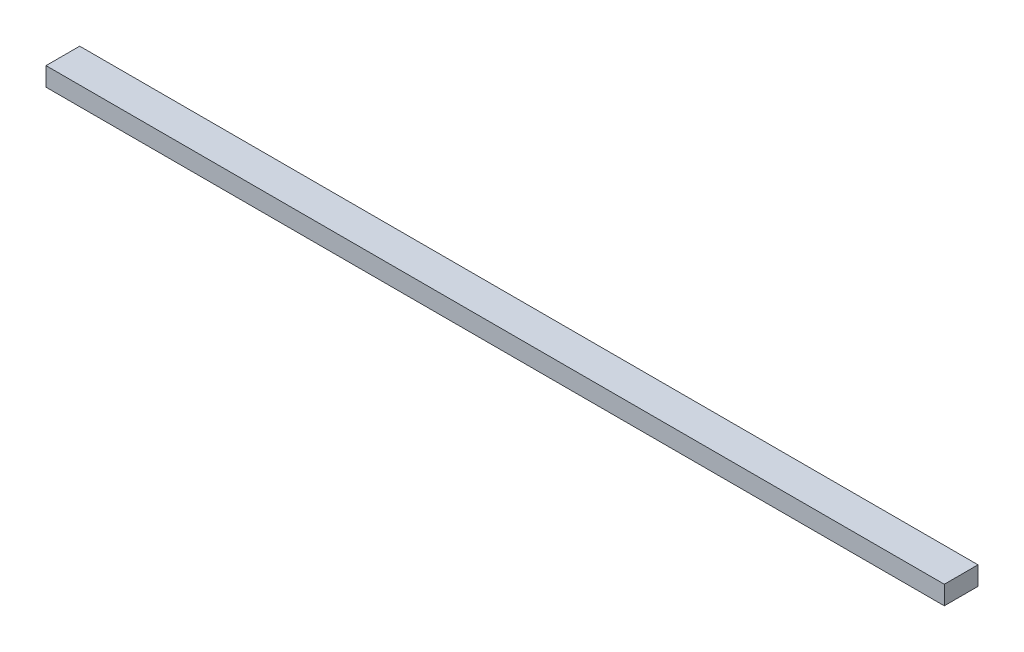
from build123d import *

# Parameters (mm, degrees)
SKETCH1_W           = 609.6
SKETCH1_H           = 22.86
BOSS_EXTRUDE1_DEPTH = 12.7


with BuildPart() as part:
    # Sketch1 → Boss-Extrude1 (new body)
    with BuildSketch(Plane(origin=(0, 0, 0), x_dir=(1, 0, 0), z_dir=(0, 1, 0))):
        Rectangle(SKETCH1_W, SKETCH1_H)
    extrude(amount=BOSS_EXTRUDE1_DEPTH)


solid = part.part
